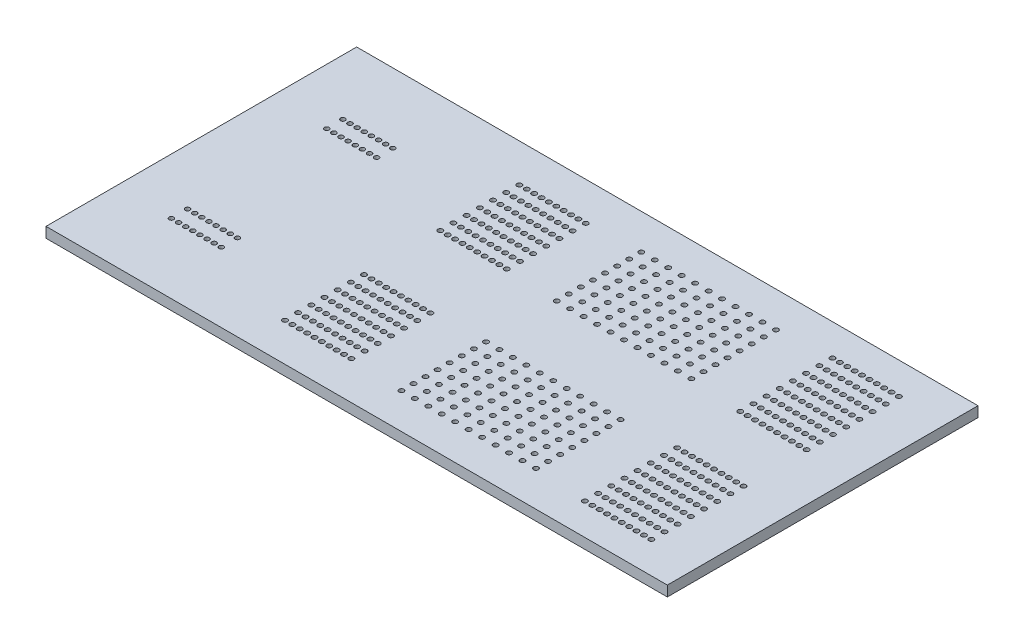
from build123d import *

# Parameters (mm, degrees)
ESQUISSE2_W                     = 120
ESQUISSE2_H                     = 30
BOSS_EXTRU_1_DEPTH              = 2
ENL_V_MAT_EXTRU_3_REACH         = 63.879
ESQUISSE8_R                     = 0.45
R_P_TITION_LIN_AIRE4_COUNT      = 8
R_P_TITION_LIN_AIRE4_PITCH      = 1.377
R_P_TITION_LIN_AIRE4_COUNT_DIR2 = 2
R_P_TITION_LIN_AIRE4_PITCH_DIR2 = 3.111
ENL_V_MAT_EXTRU_4_REACH         = 63.879
ESQUISSE10_R                    = 0.475
R_P_TITION_LIN_AIRE5_COUNT      = 10
R_P_TITION_LIN_AIRE5_PITCH      = 1.425
R_P_TITION_LIN_AIRE5_COUNT_DIR2 = 7
R_P_TITION_LIN_AIRE5_PITCH_DIR2 = 2.545
ENL_V_MAT_EXTRU_5_REACH         = 63.879
ESQUISSE12_R                    = 0.475
R_P_TITION_LIN_AIRE6_COUNT      = 11
R_P_TITION_LIN_AIRE6_PITCH      = 2.6
R_P_TITION_LIN_AIRE6_COUNT_DIR2 = 8
R_P_TITION_LIN_AIRE6_PITCH_DIR2 = 2.333
ENL_V_MAT_EXTRU_6_REACH         = 63.879
ESQUISSE14_R                    = 0.475
R_P_TITION_LIN_AIRE7_COUNT      = 10
R_P_TITION_LIN_AIRE7_PITCH      = 1.425
R_P_TITION_LIN_AIRE7_COUNT_DIR2 = 8
R_P_TITION_LIN_AIRE7_PITCH_DIR2 = 2.545


with BuildPart() as part:
    # Esquisse2 → Boss.-Extru.1 (new body)
    with BuildSketch(Plane(origin=(0, 0, 0), x_dir=(1, 0, 0), z_dir=(0, 1, 0))):
        Rectangle(ESQUISSE2_W, ESQUISSE2_H)
    extrude(amount=BOSS_EXTRU_1_DEPTH)

    # Esquisse8 → Enl_v. mat.-Extru.3 (cut, up to next)
    with BuildSketch(Plane(origin=(0, 2, 0), x_dir=(1, 0, 0), z_dir=(0, 1, 0)), mode=Mode.PRIVATE) as enl_v_mat_extru_3_sk1:
        with Locations(Location((-49.2195, 1.5555, 0), (0, 0, 270))):
            Circle(ESQUISSE8_R)
    enl_v_mat_extru_3_tool1 = extrude(enl_v_mat_extru_3_sk1.sketch, amount=-ENL_V_MAT_EXTRU_3_REACH, mode=Mode.PRIVATE) & part.part
    enl_v_mat_extru_3 = enl_v_mat_extru_3_tool1.solids().sort_by_distance((-49.2195, 2, -1.5555))[0]
    add(enl_v_mat_extru_3, mode=Mode.SUBTRACT)

    # R_p_tition lin_aire4: Enl_v. mat.-Extru.3 8 × 2
    with Locations(*[(i * R_P_TITION_LIN_AIRE4_PITCH, 0, j * R_P_TITION_LIN_AIRE4_PITCH_DIR2) for i in range(R_P_TITION_LIN_AIRE4_COUNT) for j in range(R_P_TITION_LIN_AIRE4_COUNT_DIR2) if (i, j) != (0, 0)]):
        add(enl_v_mat_extru_3, mode=Mode.SUBTRACT)

    # Esquisse10 → Enl_v. mat.-Extru.4 (cut, up to next)
    with BuildSketch(Plane(origin=(0, 2, 0), x_dir=(1, 0, 0), z_dir=(0, 1, 0)), mode=Mode.PRIVATE) as enl_v_mat_extru_4_sk1:
        with Locations(Location((-21.2125, 7.635, 0), (0, 0, 270))):
            Circle(ESQUISSE10_R)
    enl_v_mat_extru_4_tool1 = extrude(enl_v_mat_extru_4_sk1.sketch, amount=-ENL_V_MAT_EXTRU_4_REACH, mode=Mode.PRIVATE) & part.part
    enl_v_mat_extru_4 = enl_v_mat_extru_4_tool1.solids().sort_by_distance((-21.2125, 2, -7.635))[0]
    add(enl_v_mat_extru_4, mode=Mode.SUBTRACT)

    # R_p_tition lin_aire5: Enl_v. mat.-Extru.4 10 × 7
    with Locations(*[(i * R_P_TITION_LIN_AIRE5_PITCH, 0, j * R_P_TITION_LIN_AIRE5_PITCH_DIR2) for i in range(R_P_TITION_LIN_AIRE5_COUNT) for j in range(R_P_TITION_LIN_AIRE5_COUNT_DIR2) if (i, j) != (0, 0)]):
        add(enl_v_mat_extru_4, mode=Mode.SUBTRACT)

    # Esquisse12 → Enl_v. mat.-Extru.5 (cut, up to next)
    with BuildSketch(Plane(origin=(0, 2, 0), x_dir=(1, 0, 0), z_dir=(0, 1, 0)), mode=Mode.PRIVATE) as enl_v_mat_extru_5_sk1:
        with Locations(Location((1.8, 8.1655, 0), (0, 0, 270))):
            Circle(ESQUISSE12_R)
    enl_v_mat_extru_5_tool1 = extrude(enl_v_mat_extru_5_sk1.sketch, amount=-ENL_V_MAT_EXTRU_5_REACH, mode=Mode.PRIVATE) & part.part
    enl_v_mat_extru_5 = enl_v_mat_extru_5_tool1.solids().sort_by_distance((1.8, 2, -8.1655))[0]
    add(enl_v_mat_extru_5, mode=Mode.SUBTRACT)

    # R_p_tition lin_aire6: Enl_v. mat.-Extru.5 11 × 8
    with Locations(*[(i * R_P_TITION_LIN_AIRE6_PITCH, 0, j * R_P_TITION_LIN_AIRE6_PITCH_DIR2) for i in range(R_P_TITION_LIN_AIRE6_COUNT) for j in range(R_P_TITION_LIN_AIRE6_COUNT_DIR2) if (i, j) != (0, 0)]):
        add(enl_v_mat_extru_5, mode=Mode.SUBTRACT)

    # Esquisse14 → Enl_v. mat.-Extru.6 (cut, up to next)
    with BuildSketch(Plane(origin=(0, 2, 0), x_dir=(1, 0, 0), z_dir=(0, 1, 0)), mode=Mode.PRIVATE) as enl_v_mat_extru_6_sk1:
        with Locations(Location((37.9875, 8.9075, 0), (0, 0, 270))):
            Circle(ESQUISSE14_R)
    enl_v_mat_extru_6_tool1 = extrude(enl_v_mat_extru_6_sk1.sketch, amount=-ENL_V_MAT_EXTRU_6_REACH, mode=Mode.PRIVATE) & part.part
    enl_v_mat_extru_6 = enl_v_mat_extru_6_tool1.solids().sort_by_distance((37.9875, 2, -8.9075))[0]
    add(enl_v_mat_extru_6, mode=Mode.SUBTRACT)

    # R_p_tition lin_aire7: Enl_v. mat.-Extru.6 10 × 8
    with Locations(*[(i * R_P_TITION_LIN_AIRE7_PITCH, 0, j * R_P_TITION_LIN_AIRE7_PITCH_DIR2) for i in range(R_P_TITION_LIN_AIRE7_COUNT) for j in range(R_P_TITION_LIN_AIRE7_COUNT_DIR2) if (i, j) != (0, 0)]):
        add(enl_v_mat_extru_6, mode=Mode.SUBTRACT)

    # Sym_trie1: part across plane


with BuildPart() as part_1:
    add(part.part)
    add(part.part.mirror(Plane(origin=(-60, 2, 15), x_dir=(1, 0, 0), z_dir=(0, 0, -1))))


solid = part_1.part
